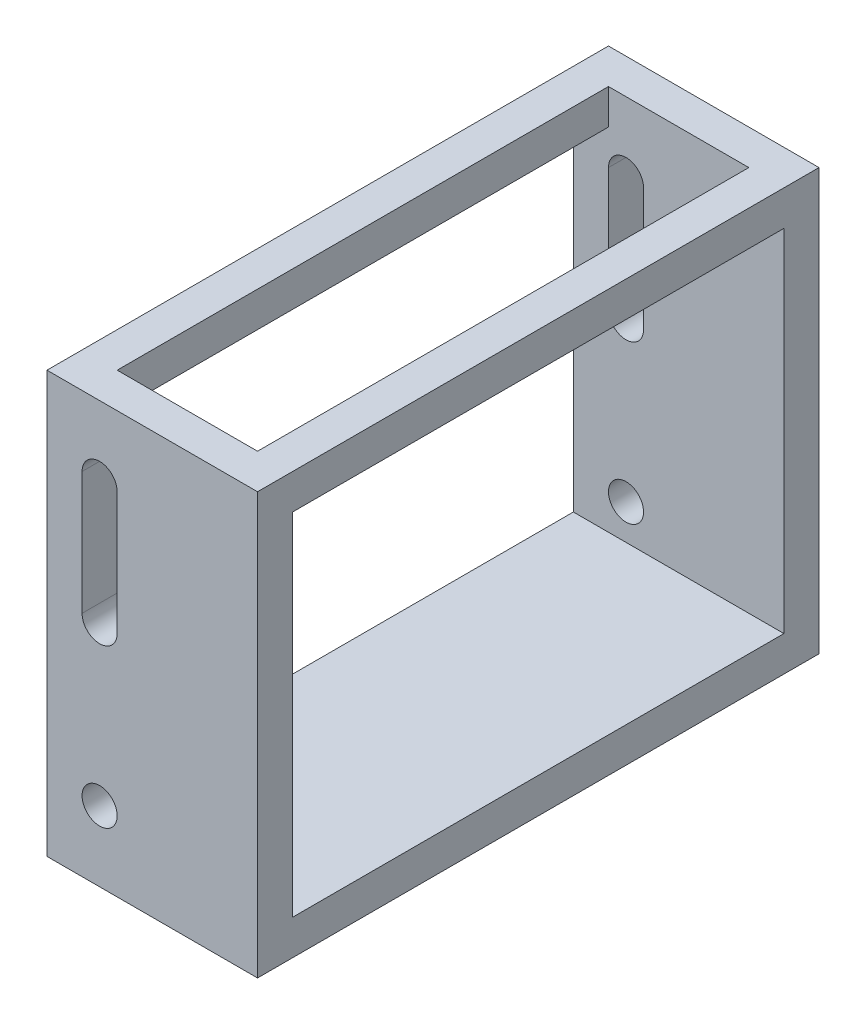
ISO-10303-21;
HEADER;
FILE_DESCRIPTION(('STEP AP214'),'2;1');
FILE_NAME('part.step','',(''),(''),'','','');
FILE_SCHEMA(('AUTOMOTIVE_DESIGN { 1 0 10303 214 1 1 1 1 }'));
ENDSEC;
DATA;
#1=APPLICATION_CONTEXT('core data for automotive mechanical design processes');
#2=APPLICATION_PROTOCOL_DEFINITION('international standard','automotive_design',2000,#1);
#3=PRODUCT_CONTEXT('',#1,'mechanical');
#4=PRODUCT('Part','Part','',(#3));
#5=PRODUCT_RELATED_PRODUCT_CATEGORY('part','',(#4));
#6=PRODUCT_DEFINITION_FORMATION('','',#4);
#7=PRODUCT_DEFINITION_CONTEXT('part definition',#1,'design');
#8=PRODUCT_DEFINITION('design','',#6,#7);
#9=PRODUCT_DEFINITION_SHAPE('','',#8);
#10=(LENGTH_UNIT() NAMED_UNIT(*) SI_UNIT(.MILLI.,.METRE.));
#11=(NAMED_UNIT(*) PLANE_ANGLE_UNIT() SI_UNIT($,.RADIAN.));
#12=(NAMED_UNIT(*) SI_UNIT($,.STERADIAN.) SOLID_ANGLE_UNIT());
#13=UNCERTAINTY_MEASURE_WITH_UNIT(LENGTH_MEASURE(1.E-05),#10,'distance_accuracy_value','');
#14=(GEOMETRIC_REPRESENTATION_CONTEXT(3) GLOBAL_UNCERTAINTY_ASSIGNED_CONTEXT((#13)) GLOBAL_UNIT_ASSIGNED_CONTEXT((#10,
#11,#12)) REPRESENTATION_CONTEXT('',''));
#15=CARTESIAN_POINT('',(0.,0.,0.));
#16=DIRECTION('',(0.,0.,1.));
#17=DIRECTION('',(1.,0.,0.));
#18=AXIS2_PLACEMENT_3D('',#15,#16,#17);
#19=CARTESIAN_POINT('',(0.,12.7,0.));
#20=DIRECTION('',(0.,-1.,0.));
#21=DIRECTION('',(0.,0.,-1.));
#22=AXIS2_PLACEMENT_3D('',#19,#20,#21);
#23=PLANE('',#22);
#24=DIRECTION('',(-1.,0.,0.));
#25=VECTOR('',#24,1.);
#26=CARTESIAN_POINT('',(76.2,12.7,-12.7));
#27=LINE('',#26,#25);
#28=CARTESIAN_POINT('',(76.2,12.7,-12.7));
#29=VERTEX_POINT('',#28);
#30=CARTESIAN_POINT('',(0.,12.7,-12.7));
#31=VERTEX_POINT('',#30);
#32=EDGE_CURVE('E283',#29,#31,#27,.T.);
#33=ORIENTED_EDGE('',*,*,#32,.F.);
#34=DIRECTION('',(0.,0.,-1.));
#35=VECTOR('',#34,1.);
#36=CARTESIAN_POINT('',(76.2,12.7,0.));
#37=LINE('',#36,#35);
#38=CARTESIAN_POINT('',(76.2,12.7,-190.5));
#39=VERTEX_POINT('',#38);
#40=EDGE_CURVE('E309',#29,#39,#37,.T.);
#41=ORIENTED_EDGE('',*,*,#40,.T.);
#42=DIRECTION('',(1.,0.,0.));
#43=VECTOR('',#42,1.);
#44=CARTESIAN_POINT('',(0.,12.7,-190.5));
#45=LINE('',#44,#43);
#46=CARTESIAN_POINT('',(0.,12.7,-190.5));
#47=VERTEX_POINT('',#46);
#48=EDGE_CURVE('E295',#47,#39,#45,.T.);
#49=ORIENTED_EDGE('',*,*,#48,.F.);
#50=DIRECTION('',(0.,0.,1.));
#51=VECTOR('',#50,1.);
#52=CARTESIAN_POINT('',(0.,12.7,0.));
#53=LINE('',#52,#51);
#54=EDGE_CURVE('E307',#47,#31,#53,.T.);
#55=ORIENTED_EDGE('',*,*,#54,.T.);
#56=EDGE_LOOP('',(#33,#41,#49,#55));
#57=FACE_BOUND('',#56,.T.);
#58=ADVANCED_FACE('F33',(#57),#23,.F.);
#59=CARTESIAN_POINT('',(0.,12.7,0.));
#60=DIRECTION('',(1.,0.,0.));
#61=DIRECTION('',(0.,0.,-1.));
#62=AXIS2_PLACEMENT_3D('',#59,#60,#61);
#63=PLANE('',#62);
#64=DIRECTION('',(0.,-1.,0.));
#65=VECTOR('',#64,1.);
#66=CARTESIAN_POINT('',(0.,139.7,-190.5));
#67=LINE('',#66,#65);
#68=CARTESIAN_POINT('',(0.,139.7,-190.5));
#69=VERTEX_POINT('',#68);
#70=EDGE_CURVE('E303',#69,#47,#67,.T.);
#71=ORIENTED_EDGE('',*,*,#70,.F.);
#72=DIRECTION('',(0.,0.,1.));
#73=VECTOR('',#72,1.);
#74=CARTESIAN_POINT('',(0.,139.7,-203.2));
#75=LINE('',#74,#73);
#76=CARTESIAN_POINT('',(0.,139.7,-12.7));
#77=VERTEX_POINT('',#76);
#78=EDGE_CURVE('E262',#69,#77,#75,.T.);
#79=ORIENTED_EDGE('',*,*,#78,.T.);
#80=DIRECTION('',(0.,-1.,0.));
#81=VECTOR('',#80,1.);
#82=CARTESIAN_POINT('',(0.,139.7,-12.7));
#83=LINE('',#82,#81);
#84=EDGE_CURVE('E286',#77,#31,#83,.T.);
#85=ORIENTED_EDGE('',*,*,#84,.T.);
#86=ORIENTED_EDGE('',*,*,#54,.F.);
#87=EDGE_LOOP('',(#71,#79,#85,#86));
#88=FACE_BOUND('',#87,.T.);
#89=DIRECTION('',(0.,0.,1.));
#90=VECTOR('',#89,1.);
#91=CARTESIAN_POINT('',(0.,0.,0.));
#92=LINE('',#91,#90);
#93=CARTESIAN_POINT('',(0.,0.,-203.2));
#94=VERTEX_POINT('',#93);
#95=CARTESIAN_POINT('',(0.,0.,0.));
#96=VERTEX_POINT('',#95);
#97=EDGE_CURVE('E306',#94,#96,#92,.T.);
#98=ORIENTED_EDGE('',*,*,#97,.T.);
#99=DIRECTION('',(0.,-1.,0.));
#100=VECTOR('',#99,1.);
#101=CARTESIAN_POINT('',(0.,12.7,0.));
#102=LINE('',#101,#100);
#103=CARTESIAN_POINT('',(0.,152.4,0.));
#104=VERTEX_POINT('',#103);
#105=EDGE_CURVE('E328',#104,#96,#102,.T.);
#106=ORIENTED_EDGE('',*,*,#105,.F.);
#107=DIRECTION('',(0.,0.,1.));
#108=VECTOR('',#107,1.);
#109=CARTESIAN_POINT('',(0.,152.4,-203.2));
#110=LINE('',#109,#108);
#111=CARTESIAN_POINT('',(0.,152.4,-203.2));
#112=VERTEX_POINT('',#111);
#113=EDGE_CURVE('E266',#112,#104,#110,.T.);
#114=ORIENTED_EDGE('',*,*,#113,.F.);
#115=DIRECTION('',(0.,-1.,0.));
#116=VECTOR('',#115,1.);
#117=CARTESIAN_POINT('',(0.,12.7,-203.2));
#118=LINE('',#117,#116);
#119=EDGE_CURVE('E312',#112,#94,#118,.T.);
#120=ORIENTED_EDGE('',*,*,#119,.T.);
#121=EDGE_LOOP('',(#98,#106,#114,#120));
#122=FACE_BOUND('',#121,.T.);
#123=ADVANCED_FACE('F35',(#88,#122),#63,.F.);
#124=CARTESIAN_POINT('',(0.,12.7,0.));
#125=DIRECTION('',(0.,0.,-1.));
#126=DIRECTION('',(-1.,0.,0.));
#127=AXIS2_PLACEMENT_3D('',#124,#125,#126);
#128=PLANE('',#127);
#129=CARTESIAN_POINT('',(19.05,25.4,0.));
#130=DIRECTION('',(0.,0.,1.));
#131=DIRECTION('',(1.,0.,0.));
#132=AXIS2_PLACEMENT_3D('',#129,#130,#131);
#133=CIRCLE('',#132,6.35);
#134=CARTESIAN_POINT('',(25.4,25.4,0.));
#135=VERTEX_POINT('',#134);
#136=EDGE_CURVE('E203',#135,#135,#133,.T.);
#137=ORIENTED_EDGE('',*,*,#136,.F.);
#138=EDGE_LOOP('',(#137));
#139=FACE_BOUND('',#138,.T.);
#140=DIRECTION('',(0.,-1.,0.));
#141=VECTOR('',#140,1.);
#142=CARTESIAN_POINT('',(12.7,127.,0.));
#143=LINE('',#142,#141);
#144=CARTESIAN_POINT('',(12.7,127.,0.));
#145=VERTEX_POINT('',#144);
#146=CARTESIAN_POINT('',(12.7,82.55,0.));
#147=VERTEX_POINT('',#146);
#148=EDGE_CURVE('E209',#145,#147,#143,.T.);
#149=ORIENTED_EDGE('',*,*,#148,.F.);
#150=CARTESIAN_POINT('',(19.05,127.,0.));
#151=DIRECTION('',(0.,0.,1.));
#152=DIRECTION('',(1.,0.,0.));
#153=AXIS2_PLACEMENT_3D('',#150,#151,#152);
#154=CIRCLE('',#153,6.35);
#155=CARTESIAN_POINT('',(25.4,127.,0.));
#156=VERTEX_POINT('',#155);
#157=EDGE_CURVE('E49',#156,#145,#154,.T.);
#158=ORIENTED_EDGE('',*,*,#157,.F.);
#159=DIRECTION('',(0.,1.,0.));
#160=VECTOR('',#159,1.);
#161=CARTESIAN_POINT('',(25.4,127.,0.));
#162=LINE('',#161,#160);
#163=CARTESIAN_POINT('',(25.4,82.55,0.));
#164=VERTEX_POINT('',#163);
#165=EDGE_CURVE('E197',#164,#156,#162,.T.);
#166=ORIENTED_EDGE('',*,*,#165,.F.);
#167=CARTESIAN_POINT('',(19.05,82.55,0.));
#168=DIRECTION('',(0.,0.,1.));
#169=DIRECTION('',(1.,0.,0.));
#170=AXIS2_PLACEMENT_3D('',#167,#168,#169);
#171=CIRCLE('',#170,6.35);
#172=EDGE_CURVE('E200',#147,#164,#171,.T.);
#173=ORIENTED_EDGE('',*,*,#172,.F.);
#174=EDGE_LOOP('',(#149,#158,#166,#173));
#175=FACE_BOUND('',#174,.T.);
#176=DIRECTION('',(1.,0.,0.));
#177=VECTOR('',#176,1.);
#178=CARTESIAN_POINT('',(0.,0.,0.));
#179=LINE('',#178,#177);
#180=CARTESIAN_POINT('',(76.2,0.,0.));
#181=VERTEX_POINT('',#180);
#182=EDGE_CURVE('E315',#96,#181,#179,.T.);
#183=ORIENTED_EDGE('',*,*,#182,.T.);
#184=DIRECTION('',(0.,-1.,0.));
#185=VECTOR('',#184,1.);
#186=CARTESIAN_POINT('',(76.2,12.7,0.));
#187=LINE('',#186,#185);
#188=CARTESIAN_POINT('',(76.2,152.4,0.));
#189=VERTEX_POINT('',#188);
#190=EDGE_CURVE('E325',#189,#181,#187,.T.);
#191=ORIENTED_EDGE('',*,*,#190,.F.);
#192=DIRECTION('',(1.,0.,0.));
#193=VECTOR('',#192,1.);
#194=CARTESIAN_POINT('',(0.,152.4,0.));
#195=LINE('',#194,#193);
#196=EDGE_CURVE('E270',#104,#189,#195,.T.);
#197=ORIENTED_EDGE('',*,*,#196,.F.);
#198=ORIENTED_EDGE('',*,*,#105,.T.);
#199=EDGE_LOOP('',(#183,#191,#197,#198));
#200=FACE_BOUND('',#199,.T.);
#201=ADVANCED_FACE('F352',(#139,#175,#200),#128,.F.);
#202=CARTESIAN_POINT('',(76.2,12.7,0.));
#203=DIRECTION('',(-1.,0.,0.));
#204=DIRECTION('',(0.,0.,1.));
#205=AXIS2_PLACEMENT_3D('',#202,#203,#204);
#206=PLANE('',#205);
#207=DIRECTION('',(0.,-1.,0.));
#208=VECTOR('',#207,1.);
#209=CARTESIAN_POINT('',(76.2,12.7,-203.2));
#210=LINE('',#209,#208);
#211=CARTESIAN_POINT('',(76.2,152.4,-203.2));
#212=VERTEX_POINT('',#211);
#213=CARTESIAN_POINT('',(76.2,0.,-203.2));
#214=VERTEX_POINT('',#213);
#215=EDGE_CURVE('E322',#212,#214,#210,.T.);
#216=ORIENTED_EDGE('',*,*,#215,.F.);
#217=DIRECTION('',(0.,0.,-1.));
#218=VECTOR('',#217,1.);
#219=CARTESIAN_POINT('',(76.2,152.4,0.));
#220=LINE('',#219,#218);
#221=EDGE_CURVE('E273',#189,#212,#220,.T.);
#222=ORIENTED_EDGE('',*,*,#221,.F.);
#223=ORIENTED_EDGE('',*,*,#190,.T.);
#224=DIRECTION('',(0.,0.,-1.));
#225=VECTOR('',#224,1.);
#226=CARTESIAN_POINT('',(76.2,0.,0.));
#227=LINE('',#226,#225);
#228=EDGE_CURVE('E317',#181,#214,#227,.T.);
#229=ORIENTED_EDGE('',*,*,#228,.T.);
#230=EDGE_LOOP('',(#216,#222,#223,#229));
#231=FACE_BOUND('',#230,.T.);
#232=DIRECTION('',(0.,0.,-1.));
#233=VECTOR('',#232,1.);
#234=CARTESIAN_POINT('',(76.2,139.7,0.));
#235=LINE('',#234,#233);
#236=CARTESIAN_POINT('',(76.2,139.7,-12.7));
#237=VERTEX_POINT('',#236);
#238=CARTESIAN_POINT('',(76.2,139.7,-190.5));
#239=VERTEX_POINT('',#238);
#240=EDGE_CURVE('E267',#237,#239,#235,.T.);
#241=ORIENTED_EDGE('',*,*,#240,.T.);
#242=DIRECTION('',(0.,-1.,0.));
#243=VECTOR('',#242,1.);
#244=CARTESIAN_POINT('',(76.2,139.7,-190.5));
#245=LINE('',#244,#243);
#246=EDGE_CURVE('E298',#239,#39,#245,.T.);
#247=ORIENTED_EDGE('',*,*,#246,.T.);
#248=ORIENTED_EDGE('',*,*,#40,.F.);
#249=DIRECTION('',(0.,-1.,0.));
#250=VECTOR('',#249,1.);
#251=CARTESIAN_POINT('',(76.2,139.7,-12.7));
#252=LINE('',#251,#250);
#253=EDGE_CURVE('E292',#237,#29,#252,.T.);
#254=ORIENTED_EDGE('',*,*,#253,.F.);
#255=EDGE_LOOP('',(#241,#247,#248,#254));
#256=FACE_BOUND('',#255,.T.);
#257=ADVANCED_FACE('F390',(#231,#256),#206,.F.);
#258=CARTESIAN_POINT('',(0.,12.7,-203.2));
#259=DIRECTION('',(0.,0.,1.));
#260=DIRECTION('',(1.,0.,0.));
#261=AXIS2_PLACEMENT_3D('',#258,#259,#260);
#262=PLANE('',#261);
#263=CARTESIAN_POINT('',(19.05,25.4,-203.2));
#264=DIRECTION('',(0.,0.,1.));
#265=DIRECTION('',(1.,0.,0.));
#266=AXIS2_PLACEMENT_3D('',#263,#264,#265);
#267=CIRCLE('',#266,6.35);
#268=CARTESIAN_POINT('',(25.4,25.4,-203.2));
#269=VERTEX_POINT('',#268);
#270=EDGE_CURVE('E225',#269,#269,#267,.T.);
#271=ORIENTED_EDGE('',*,*,#270,.T.);
#272=EDGE_LOOP('',(#271));
#273=FACE_BOUND('',#272,.T.);
#274=DIRECTION('',(0.,1.,0.));
#275=VECTOR('',#274,1.);
#276=CARTESIAN_POINT('',(25.4,127.,-203.2));
#277=LINE('',#276,#275);
#278=CARTESIAN_POINT('',(25.4,82.55,-203.2));
#279=VERTEX_POINT('',#278);
#280=CARTESIAN_POINT('',(25.4,127.,-203.2));
#281=VERTEX_POINT('',#280);
#282=EDGE_CURVE('E196',#279,#281,#277,.T.);
#283=ORIENTED_EDGE('',*,*,#282,.T.);
#284=CARTESIAN_POINT('',(19.05,127.,-203.2));
#285=DIRECTION('',(0.,0.,1.));
#286=DIRECTION('',(1.,0.,0.));
#287=AXIS2_PLACEMENT_3D('',#284,#285,#286);
#288=CIRCLE('',#287,6.35);
#289=CARTESIAN_POINT('',(12.7,127.,-203.2));
#290=VERTEX_POINT('',#289);
#291=EDGE_CURVE('E178',#281,#290,#288,.T.);
#292=ORIENTED_EDGE('',*,*,#291,.T.);
#293=DIRECTION('',(0.,-1.,0.));
#294=VECTOR('',#293,1.);
#295=CARTESIAN_POINT('',(12.7,127.,-203.2));
#296=LINE('',#295,#294);
#297=CARTESIAN_POINT('',(12.7,82.55,-203.2));
#298=VERTEX_POINT('',#297);
#299=EDGE_CURVE('E188',#290,#298,#296,.T.);
#300=ORIENTED_EDGE('',*,*,#299,.T.);
#301=CARTESIAN_POINT('',(19.05,82.55,-203.2));
#302=DIRECTION('',(0.,0.,1.));
#303=DIRECTION('',(1.,0.,0.));
#304=AXIS2_PLACEMENT_3D('',#301,#302,#303);
#305=CIRCLE('',#304,6.35);
#306=EDGE_CURVE('E57',#298,#279,#305,.T.);
#307=ORIENTED_EDGE('',*,*,#306,.T.);
#308=EDGE_LOOP('',(#283,#292,#300,#307));
#309=FACE_BOUND('',#308,.T.);
#310=DIRECTION('',(-1.,0.,0.));
#311=VECTOR('',#310,1.);
#312=CARTESIAN_POINT('',(0.,0.,-203.2));
#313=LINE('',#312,#311);
#314=EDGE_CURVE('E310',#214,#94,#313,.T.);
#315=ORIENTED_EDGE('',*,*,#314,.T.);
#316=ORIENTED_EDGE('',*,*,#119,.F.);
#317=DIRECTION('',(-1.,0.,0.));
#318=VECTOR('',#317,1.);
#319=CARTESIAN_POINT('',(76.2,152.4,-203.2));
#320=LINE('',#319,#318);
#321=EDGE_CURVE('E263',#212,#112,#320,.T.);
#322=ORIENTED_EDGE('',*,*,#321,.F.);
#323=ORIENTED_EDGE('',*,*,#215,.T.);
#324=EDGE_LOOP('',(#315,#316,#322,#323));
#325=FACE_BOUND('',#324,.T.);
#326=ADVANCED_FACE('F193',(#273,#309,#325),#262,.F.);
#327=CARTESIAN_POINT('',(0.,0.,0.));
#328=DIRECTION('',(0.,-1.,0.));
#329=DIRECTION('',(0.,0.,-1.));
#330=AXIS2_PLACEMENT_3D('',#327,#328,#329);
#331=PLANE('',#330);
#332=ORIENTED_EDGE('',*,*,#97,.F.);
#333=ORIENTED_EDGE('',*,*,#314,.F.);
#334=ORIENTED_EDGE('',*,*,#228,.F.);
#335=ORIENTED_EDGE('',*,*,#182,.F.);
#336=EDGE_LOOP('',(#332,#333,#334,#335));
#337=FACE_BOUND('',#336,.T.);
#338=ADVANCED_FACE('F384',(#337),#331,.T.);
#339=CARTESIAN_POINT('',(0.,139.7,-190.5));
#340=DIRECTION('',(0.,0.,-1.));
#341=DIRECTION('',(-1.,0.,0.));
#342=AXIS2_PLACEMENT_3D('',#339,#340,#341);
#343=PLANE('',#342);
#344=CARTESIAN_POINT('',(19.05,25.4,-190.5));
#345=DIRECTION('',(0.,0.,-1.));
#346=DIRECTION('',(-1.,0.,0.));
#347=AXIS2_PLACEMENT_3D('',#344,#345,#346);
#348=CIRCLE('',#347,6.35);
#349=CARTESIAN_POINT('',(12.7,25.4,-190.5));
#350=VERTEX_POINT('',#349);
#351=EDGE_CURVE('E232',#350,#350,#348,.T.);
#352=ORIENTED_EDGE('',*,*,#351,.T.);
#353=EDGE_LOOP('',(#352));
#354=FACE_BOUND('',#353,.T.);
#355=DIRECTION('',(0.,1.,0.));
#356=VECTOR('',#355,1.);
#357=CARTESIAN_POINT('',(12.7,139.7,-190.5));
#358=LINE('',#357,#356);
#359=CARTESIAN_POINT('',(12.7,82.55,-190.5));
#360=VERTEX_POINT('',#359);
#361=CARTESIAN_POINT('',(12.7,127.,-190.5));
#362=VERTEX_POINT('',#361);
#363=EDGE_CURVE('E222',#360,#362,#358,.T.);
#364=ORIENTED_EDGE('',*,*,#363,.T.);
#365=CARTESIAN_POINT('',(19.05,127.,-190.5));
#366=DIRECTION('',(0.,0.,-1.));
#367=DIRECTION('',(-1.,0.,0.));
#368=AXIS2_PLACEMENT_3D('',#365,#366,#367);
#369=CIRCLE('',#368,6.35);
#370=CARTESIAN_POINT('',(25.4,127.,-190.5));
#371=VERTEX_POINT('',#370);
#372=EDGE_CURVE('E181',#362,#371,#369,.T.);
#373=ORIENTED_EDGE('',*,*,#372,.T.);
#374=DIRECTION('',(0.,-1.,0.));
#375=VECTOR('',#374,1.);
#376=CARTESIAN_POINT('',(25.4,139.7,-190.5));
#377=LINE('',#376,#375);
#378=CARTESIAN_POINT('',(25.4,82.55,-190.5));
#379=VERTEX_POINT('',#378);
#380=EDGE_CURVE('E228',#371,#379,#377,.T.);
#381=ORIENTED_EDGE('',*,*,#380,.T.);
#382=CARTESIAN_POINT('',(19.05,82.55,-190.5));
#383=DIRECTION('',(0.,0.,-1.));
#384=DIRECTION('',(-1.,0.,0.));
#385=AXIS2_PLACEMENT_3D('',#382,#383,#384);
#386=CIRCLE('',#385,6.35);
#387=EDGE_CURVE('E224',#379,#360,#386,.T.);
#388=ORIENTED_EDGE('',*,*,#387,.T.);
#389=EDGE_LOOP('',(#364,#373,#381,#388));
#390=FACE_BOUND('',#389,.T.);
#391=ORIENTED_EDGE('',*,*,#48,.T.);
#392=ORIENTED_EDGE('',*,*,#246,.F.);
#393=DIRECTION('',(1.,0.,0.));
#394=VECTOR('',#393,1.);
#395=CARTESIAN_POINT('',(0.,139.7,-190.5));
#396=LINE('',#395,#394);
#397=CARTESIAN_POINT('',(63.5,139.7,-190.5));
#398=VERTEX_POINT('',#397);
#399=EDGE_CURVE('E276',#398,#239,#396,.T.);
#400=ORIENTED_EDGE('',*,*,#399,.F.);
#401=DIRECTION('',(0.,-1.,0.));
#402=VECTOR('',#401,1.);
#403=CARTESIAN_POINT('',(63.5,152.4,-190.5));
#404=LINE('',#403,#402);
#405=CARTESIAN_POINT('',(63.5,152.4,-190.5));
#406=VERTEX_POINT('',#405);
#407=EDGE_CURVE('E253',#406,#398,#404,.T.);
#408=ORIENTED_EDGE('',*,*,#407,.F.);
#409=DIRECTION('',(-1.,0.,0.));
#410=VECTOR('',#409,1.);
#411=CARTESIAN_POINT('',(12.7,152.4,-190.5));
#412=LINE('',#411,#410);
#413=CARTESIAN_POINT('',(12.7,152.4,-190.5));
#414=VERTEX_POINT('',#413);
#415=EDGE_CURVE('E244',#406,#414,#412,.T.);
#416=ORIENTED_EDGE('',*,*,#415,.T.);
#417=DIRECTION('',(0.,-1.,0.));
#418=VECTOR('',#417,1.);
#419=CARTESIAN_POINT('',(12.7,152.4,-190.5));
#420=LINE('',#419,#418);
#421=CARTESIAN_POINT('',(12.7,139.7,-190.5));
#422=VERTEX_POINT('',#421);
#423=EDGE_CURVE('E246',#414,#422,#420,.T.);
#424=ORIENTED_EDGE('',*,*,#423,.T.);
#425=DIRECTION('',(1.,0.,0.));
#426=VECTOR('',#425,1.);
#427=CARTESIAN_POINT('',(0.,139.7,-190.5));
#428=LINE('',#427,#426);
#429=EDGE_CURVE('E296',#69,#422,#428,.T.);
#430=ORIENTED_EDGE('',*,*,#429,.F.);
#431=ORIENTED_EDGE('',*,*,#70,.T.);
#432=EDGE_LOOP('',(#391,#392,#400,#408,#416,#424,#430,#431));
#433=FACE_BOUND('',#432,.T.);
#434=ADVANCED_FACE('F382',(#354,#390,#433),#343,.F.);
#435=CARTESIAN_POINT('',(76.2,139.7,-12.7));
#436=DIRECTION('',(0.,0.,1.));
#437=DIRECTION('',(1.,0.,0.));
#438=AXIS2_PLACEMENT_3D('',#435,#436,#437);
#439=PLANE('',#438);
#440=CARTESIAN_POINT('',(19.05,25.4,-12.7));
#441=DIRECTION('',(0.,0.,1.));
#442=DIRECTION('',(1.,0.,0.));
#443=AXIS2_PLACEMENT_3D('',#440,#441,#442);
#444=CIRCLE('',#443,6.35);
#445=CARTESIAN_POINT('',(25.4,25.4,-12.7));
#446=VERTEX_POINT('',#445);
#447=EDGE_CURVE('E37',#446,#446,#444,.T.);
#448=ORIENTED_EDGE('',*,*,#447,.T.);
#449=EDGE_LOOP('',(#448));
#450=FACE_BOUND('',#449,.T.);
#451=DIRECTION('',(0.,1.,0.));
#452=VECTOR('',#451,1.);
#453=CARTESIAN_POINT('',(25.4,139.7,-12.7));
#454=LINE('',#453,#452);
#455=CARTESIAN_POINT('',(25.4,82.55,-12.7));
#456=VERTEX_POINT('',#455);
#457=CARTESIAN_POINT('',(25.4,127.,-12.7));
#458=VERTEX_POINT('',#457);
#459=EDGE_CURVE('E42',#456,#458,#454,.T.);
#460=ORIENTED_EDGE('',*,*,#459,.T.);
#461=CARTESIAN_POINT('',(19.05,127.,-12.7));
#462=DIRECTION('',(0.,0.,1.));
#463=DIRECTION('',(1.,0.,0.));
#464=AXIS2_PLACEMENT_3D('',#461,#462,#463);
#465=CIRCLE('',#464,6.35);
#466=CARTESIAN_POINT('',(12.7,127.,-12.7));
#467=VERTEX_POINT('',#466);
#468=EDGE_CURVE('E11',#458,#467,#465,.T.);
#469=ORIENTED_EDGE('',*,*,#468,.T.);
#470=DIRECTION('',(0.,-1.,0.));
#471=VECTOR('',#470,1.);
#472=CARTESIAN_POINT('',(12.7,139.7,-12.7));
#473=LINE('',#472,#471);
#474=CARTESIAN_POINT('',(12.7,82.55,-12.7));
#475=VERTEX_POINT('',#474);
#476=EDGE_CURVE('E331',#467,#475,#473,.T.);
#477=ORIENTED_EDGE('',*,*,#476,.T.);
#478=CARTESIAN_POINT('',(19.05,82.55,-12.7));
#479=DIRECTION('',(0.,0.,1.));
#480=DIRECTION('',(1.,0.,0.));
#481=AXIS2_PLACEMENT_3D('',#478,#479,#480);
#482=CIRCLE('',#481,6.35);
#483=EDGE_CURVE('E334',#475,#456,#482,.T.);
#484=ORIENTED_EDGE('',*,*,#483,.T.);
#485=EDGE_LOOP('',(#460,#469,#477,#484));
#486=FACE_BOUND('',#485,.T.);
#487=ORIENTED_EDGE('',*,*,#32,.T.);
#488=ORIENTED_EDGE('',*,*,#84,.F.);
#489=DIRECTION('',(-1.,0.,0.));
#490=VECTOR('',#489,1.);
#491=CARTESIAN_POINT('',(76.2,139.7,-12.7));
#492=LINE('',#491,#490);
#493=CARTESIAN_POINT('',(12.7,139.7,-12.7));
#494=VERTEX_POINT('',#493);
#495=EDGE_CURVE('E287',#494,#77,#492,.T.);
#496=ORIENTED_EDGE('',*,*,#495,.F.);
#497=DIRECTION('',(0.,-1.,0.));
#498=VECTOR('',#497,1.);
#499=CARTESIAN_POINT('',(12.7,152.4,-12.7));
#500=LINE('',#499,#498);
#501=CARTESIAN_POINT('',(12.7,152.4,-12.7));
#502=VERTEX_POINT('',#501);
#503=EDGE_CURVE('E259',#502,#494,#500,.T.);
#504=ORIENTED_EDGE('',*,*,#503,.F.);
#505=DIRECTION('',(1.,0.,0.));
#506=VECTOR('',#505,1.);
#507=CARTESIAN_POINT('',(12.7,152.4,-12.7));
#508=LINE('',#507,#506);
#509=CARTESIAN_POINT('',(63.5,152.4,-12.7));
#510=VERTEX_POINT('',#509);
#511=EDGE_CURVE('E238',#502,#510,#508,.T.);
#512=ORIENTED_EDGE('',*,*,#511,.T.);
#513=DIRECTION('',(0.,-1.,0.));
#514=VECTOR('',#513,1.);
#515=CARTESIAN_POINT('',(63.5,152.4,-12.7));
#516=LINE('',#515,#514);
#517=CARTESIAN_POINT('',(63.5,139.7,-12.7));
#518=VERTEX_POINT('',#517);
#519=EDGE_CURVE('E256',#510,#518,#516,.T.);
#520=ORIENTED_EDGE('',*,*,#519,.T.);
#521=EDGE_CURVE('E284',#237,#518,#492,.T.);
#522=ORIENTED_EDGE('',*,*,#521,.F.);
#523=ORIENTED_EDGE('',*,*,#253,.T.);
#524=EDGE_LOOP('',(#487,#488,#496,#504,#512,#520,#522,#523));
#525=FACE_BOUND('',#524,.T.);
#526=ADVANCED_FACE('F339',(#450,#486,#525),#439,.F.);
#527=CARTESIAN_POINT('',(0.,139.7,0.));
#528=DIRECTION('',(0.,1.,0.));
#529=DIRECTION('',(0.,0.,1.));
#530=AXIS2_PLACEMENT_3D('',#527,#528,#529);
#531=PLANE('',#530);
#532=ORIENTED_EDGE('',*,*,#78,.F.);
#533=ORIENTED_EDGE('',*,*,#429,.T.);
#534=DIRECTION('',(0.,0.,1.));
#535=VECTOR('',#534,1.);
#536=CARTESIAN_POINT('',(12.7,139.7,-190.5));
#537=LINE('',#536,#535);
#538=EDGE_CURVE('E235',#422,#494,#537,.T.);
#539=ORIENTED_EDGE('',*,*,#538,.T.);
#540=ORIENTED_EDGE('',*,*,#495,.T.);
#541=EDGE_LOOP('',(#532,#533,#539,#540));
#542=FACE_BOUND('',#541,.T.);
#543=ADVANCED_FACE('F435',(#542),#531,.F.);
#544=DIRECTION('',(0.,0.,-1.));
#545=VECTOR('',#544,1.);
#546=CARTESIAN_POINT('',(63.5,139.7,-190.5));
#547=LINE('',#546,#545);
#548=EDGE_CURVE('E239',#518,#398,#547,.T.);
#549=ORIENTED_EDGE('',*,*,#548,.T.);
#550=ORIENTED_EDGE('',*,*,#399,.T.);
#551=ORIENTED_EDGE('',*,*,#240,.F.);
#552=ORIENTED_EDGE('',*,*,#521,.T.);
#553=EDGE_LOOP('',(#549,#550,#551,#552));
#554=FACE_BOUND('',#553,.T.);
#555=ADVANCED_FACE('F416',(#554),#531,.F.);
#556=CARTESIAN_POINT('',(0.,152.4,0.));
#557=DIRECTION('',(0.,1.,0.));
#558=DIRECTION('',(0.,0.,1.));
#559=AXIS2_PLACEMENT_3D('',#556,#557,#558);
#560=PLANE('',#559);
#561=ORIENTED_EDGE('',*,*,#321,.T.);
#562=ORIENTED_EDGE('',*,*,#113,.T.);
#563=ORIENTED_EDGE('',*,*,#196,.T.);
#564=ORIENTED_EDGE('',*,*,#221,.T.);
#565=EDGE_LOOP('',(#561,#562,#563,#564));
#566=FACE_BOUND('',#565,.T.);
#567=ORIENTED_EDGE('',*,*,#511,.F.);
#568=DIRECTION('',(0.,0.,1.));
#569=VECTOR('',#568,1.);
#570=CARTESIAN_POINT('',(12.7,152.4,-190.5));
#571=LINE('',#570,#569);
#572=EDGE_CURVE('E236',#414,#502,#571,.T.);
#573=ORIENTED_EDGE('',*,*,#572,.F.);
#574=ORIENTED_EDGE('',*,*,#415,.F.);
#575=DIRECTION('',(0.,0.,-1.));
#576=VECTOR('',#575,1.);
#577=CARTESIAN_POINT('',(63.5,152.4,-190.5));
#578=LINE('',#577,#576);
#579=EDGE_CURVE('E241',#510,#406,#578,.T.);
#580=ORIENTED_EDGE('',*,*,#579,.F.);
#581=EDGE_LOOP('',(#567,#573,#574,#580));
#582=FACE_BOUND('',#581,.T.);
#583=ADVANCED_FACE('F426',(#566,#582),#560,.T.);
#584=CARTESIAN_POINT('',(12.7,152.4,-190.5));
#585=DIRECTION('',(1.,0.,0.));
#586=DIRECTION('',(0.,0.,-1.));
#587=AXIS2_PLACEMENT_3D('',#584,#585,#586);
#588=PLANE('',#587);
#589=ORIENTED_EDGE('',*,*,#538,.F.);
#590=ORIENTED_EDGE('',*,*,#423,.F.);
#591=ORIENTED_EDGE('',*,*,#572,.T.);
#592=ORIENTED_EDGE('',*,*,#503,.T.);
#593=EDGE_LOOP('',(#589,#590,#591,#592));
#594=FACE_BOUND('',#593,.T.);
#595=ADVANCED_FACE('F430',(#594),#588,.T.);
#596=CARTESIAN_POINT('',(63.5,152.4,-190.5));
#597=DIRECTION('',(-1.,0.,0.));
#598=DIRECTION('',(0.,0.,1.));
#599=AXIS2_PLACEMENT_3D('',#596,#597,#598);
#600=PLANE('',#599);
#601=ORIENTED_EDGE('',*,*,#548,.F.);
#602=ORIENTED_EDGE('',*,*,#519,.F.);
#603=ORIENTED_EDGE('',*,*,#579,.T.);
#604=ORIENTED_EDGE('',*,*,#407,.T.);
#605=EDGE_LOOP('',(#601,#602,#603,#604));
#606=FACE_BOUND('',#605,.T.);
#607=ADVANCED_FACE('F419',(#606),#600,.T.);
#608=CARTESIAN_POINT('',(12.7,127.,-203.2));
#609=DIRECTION('',(-1.,0.,0.));
#610=DIRECTION('',(0.,0.,1.));
#611=AXIS2_PLACEMENT_3D('',#608,#609,#610);
#612=PLANE('',#611);
#613=DIRECTION('',(0.,0.,1.));
#614=VECTOR('',#613,1.);
#615=CARTESIAN_POINT('',(12.7,127.,-203.2));
#616=LINE('',#615,#614);
#617=EDGE_CURVE('E185',#467,#145,#616,.T.);
#618=ORIENTED_EDGE('',*,*,#617,.T.);
#619=ORIENTED_EDGE('',*,*,#148,.T.);
#620=DIRECTION('',(0.,0.,1.));
#621=VECTOR('',#620,1.);
#622=CARTESIAN_POINT('',(12.7,82.55,-203.2));
#623=LINE('',#622,#621);
#624=EDGE_CURVE('E184',#475,#147,#623,.T.);
#625=ORIENTED_EDGE('',*,*,#624,.F.);
#626=ORIENTED_EDGE('',*,*,#476,.F.);
#627=EDGE_LOOP('',(#618,#619,#625,#626));
#628=FACE_BOUND('',#627,.T.);
#629=ADVANCED_FACE('F355',(#628),#612,.F.);
#630=CARTESIAN_POINT('',(19.05,82.55,-203.2));
#631=DIRECTION('',(0.,0.,1.));
#632=DIRECTION('',(1.,0.,0.));
#633=AXIS2_PLACEMENT_3D('',#630,#631,#632);
#634=CYLINDRICAL_SURFACE('',#633,6.35);
#635=ORIENTED_EDGE('',*,*,#624,.T.);
#636=ORIENTED_EDGE('',*,*,#172,.T.);
#637=DIRECTION('',(0.,0.,1.));
#638=VECTOR('',#637,1.);
#639=CARTESIAN_POINT('',(25.4,82.55,-203.2));
#640=LINE('',#639,#638);
#641=EDGE_CURVE('E220',#456,#164,#640,.T.);
#642=ORIENTED_EDGE('',*,*,#641,.F.);
#643=ORIENTED_EDGE('',*,*,#483,.F.);
#644=EDGE_LOOP('',(#635,#636,#642,#643));
#645=FACE_BOUND('',#644,.T.);
#646=ADVANCED_FACE('F347',(#645),#634,.F.);
#647=CARTESIAN_POINT('',(25.4,127.,-203.2));
#648=DIRECTION('',(1.,0.,0.));
#649=DIRECTION('',(0.,0.,-1.));
#650=AXIS2_PLACEMENT_3D('',#647,#648,#649);
#651=PLANE('',#650);
#652=ORIENTED_EDGE('',*,*,#641,.T.);
#653=ORIENTED_EDGE('',*,*,#165,.T.);
#654=DIRECTION('',(0.,0.,1.));
#655=VECTOR('',#654,1.);
#656=CARTESIAN_POINT('',(25.4,127.,-203.2));
#657=LINE('',#656,#655);
#658=EDGE_CURVE('E216',#458,#156,#657,.T.);
#659=ORIENTED_EDGE('',*,*,#658,.F.);
#660=ORIENTED_EDGE('',*,*,#459,.F.);
#661=EDGE_LOOP('',(#652,#653,#659,#660));
#662=FACE_BOUND('',#661,.T.);
#663=ADVANCED_FACE('F345',(#662),#651,.F.);
#664=CARTESIAN_POINT('',(19.05,127.,-203.2));
#665=DIRECTION('',(0.,0.,1.));
#666=DIRECTION('',(1.,0.,0.));
#667=AXIS2_PLACEMENT_3D('',#664,#665,#666);
#668=CYLINDRICAL_SURFACE('',#667,6.35);
#669=ORIENTED_EDGE('',*,*,#658,.T.);
#670=ORIENTED_EDGE('',*,*,#157,.T.);
#671=ORIENTED_EDGE('',*,*,#617,.F.);
#672=ORIENTED_EDGE('',*,*,#468,.F.);
#673=EDGE_LOOP('',(#669,#670,#671,#672));
#674=FACE_BOUND('',#673,.T.);
#675=ADVANCED_FACE('F356',(#674),#668,.F.);
#676=CARTESIAN_POINT('',(19.05,25.4,-203.2));
#677=DIRECTION('',(0.,0.,1.));
#678=DIRECTION('',(1.,0.,0.));
#679=AXIS2_PLACEMENT_3D('',#676,#677,#678);
#680=CYLINDRICAL_SURFACE('',#679,6.35);
#681=ORIENTED_EDGE('',*,*,#136,.T.);
#682=EDGE_LOOP('',(#681));
#683=FACE_BOUND('',#682,.T.);
#684=ORIENTED_EDGE('',*,*,#447,.F.);
#685=EDGE_LOOP('',(#684));
#686=FACE_BOUND('',#685,.T.);
#687=ADVANCED_FACE('F358',(#683,#686),#680,.F.);
#688=EDGE_CURVE('E173',#290,#362,#616,.T.);
#689=ORIENTED_EDGE('',*,*,#688,.F.);
#690=ORIENTED_EDGE('',*,*,#291,.F.);
#691=EDGE_CURVE('E214',#281,#371,#657,.T.);
#692=ORIENTED_EDGE('',*,*,#691,.T.);
#693=ORIENTED_EDGE('',*,*,#372,.F.);
#694=EDGE_LOOP('',(#689,#690,#692,#693));
#695=FACE_BOUND('',#694,.T.);
#696=ADVANCED_FACE('F175',(#695),#668,.F.);
#697=ORIENTED_EDGE('',*,*,#691,.F.);
#698=ORIENTED_EDGE('',*,*,#282,.F.);
#699=EDGE_CURVE('E217',#279,#379,#640,.T.);
#700=ORIENTED_EDGE('',*,*,#699,.T.);
#701=ORIENTED_EDGE('',*,*,#380,.F.);
#702=EDGE_LOOP('',(#697,#698,#700,#701));
#703=FACE_BOUND('',#702,.T.);
#704=ADVANCED_FACE('F368',(#703),#651,.F.);
#705=ORIENTED_EDGE('',*,*,#699,.F.);
#706=ORIENTED_EDGE('',*,*,#306,.F.);
#707=EDGE_CURVE('E190',#298,#360,#623,.T.);
#708=ORIENTED_EDGE('',*,*,#707,.T.);
#709=ORIENTED_EDGE('',*,*,#387,.F.);
#710=EDGE_LOOP('',(#705,#706,#708,#709));
#711=FACE_BOUND('',#710,.T.);
#712=ADVANCED_FACE('F457',(#711),#634,.F.);
#713=ORIENTED_EDGE('',*,*,#707,.F.);
#714=ORIENTED_EDGE('',*,*,#299,.F.);
#715=ORIENTED_EDGE('',*,*,#688,.T.);
#716=ORIENTED_EDGE('',*,*,#363,.F.);
#717=EDGE_LOOP('',(#713,#714,#715,#716));
#718=FACE_BOUND('',#717,.T.);
#719=ADVANCED_FACE('F189',(#718),#612,.F.);
#720=ORIENTED_EDGE('',*,*,#270,.F.);
#721=EDGE_LOOP('',(#720));
#722=FACE_BOUND('',#721,.T.);
#723=ORIENTED_EDGE('',*,*,#351,.F.);
#724=EDGE_LOOP('',(#723));
#725=FACE_BOUND('',#724,.T.);
#726=ADVANCED_FACE('F366',(#722,#725),#680,.F.);
#727=CLOSED_SHELL('',(#58,#123,#201,#257,#326,#338,#434,#526,#543,#555,#583,#595,#607,#629,#646,
#663,#675,#687,#696,#704,#712,#719,#726));
#728=MANIFOLD_SOLID_BREP('B2',#727);
#729=ADVANCED_BREP_SHAPE_REPRESENTATION('',(#18,#728),#14);
#730=SHAPE_DEFINITION_REPRESENTATION(#9,#729);
ENDSEC;
END-ISO-10303-21;
